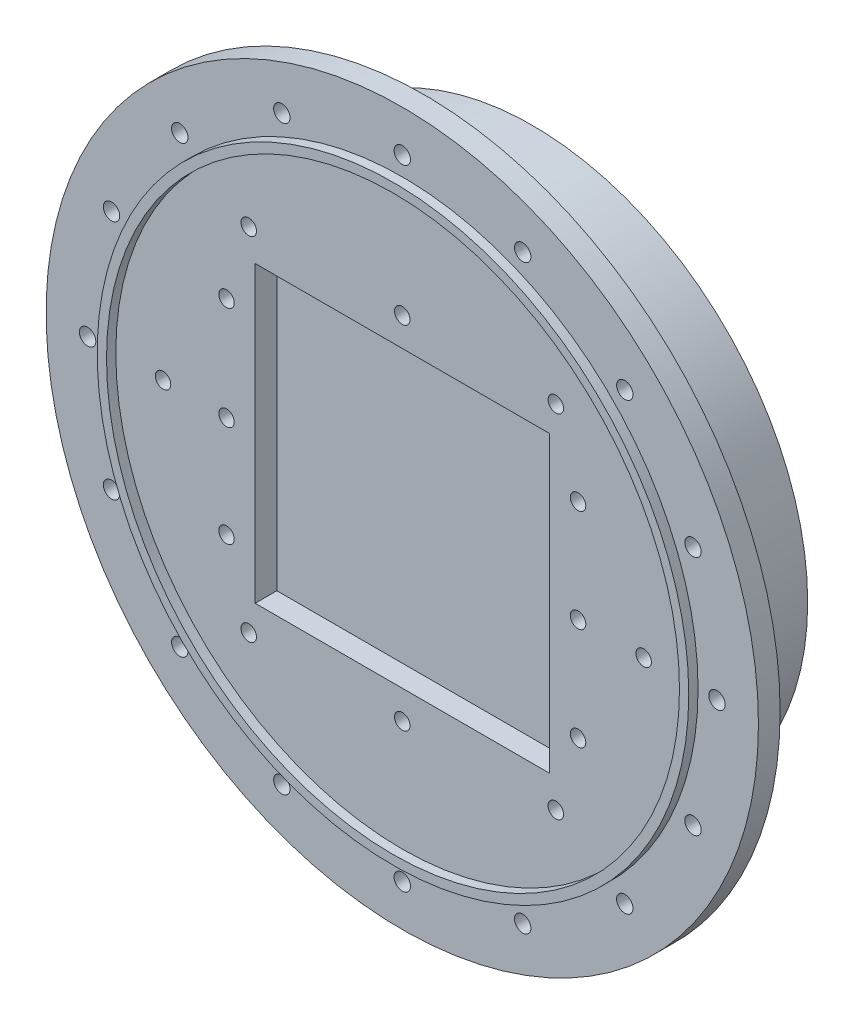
ISO-10303-21;
HEADER;
FILE_DESCRIPTION(('STEP AP214'),'2;1');
FILE_NAME('part.step','',(''),(''),'','','');
FILE_SCHEMA(('AUTOMOTIVE_DESIGN { 1 0 10303 214 1 1 1 1 }'));
ENDSEC;
DATA;
#1=APPLICATION_CONTEXT('core data for automotive mechanical design processes');
#2=APPLICATION_PROTOCOL_DEFINITION('international standard','automotive_design',2000,#1);
#3=PRODUCT_CONTEXT('',#1,'mechanical');
#4=PRODUCT('Part','Part','',(#3));
#5=PRODUCT_RELATED_PRODUCT_CATEGORY('part','',(#4));
#6=PRODUCT_DEFINITION_FORMATION('','',#4);
#7=PRODUCT_DEFINITION_CONTEXT('part definition',#1,'design');
#8=PRODUCT_DEFINITION('design','',#6,#7);
#9=PRODUCT_DEFINITION_SHAPE('','',#8);
#10=(LENGTH_UNIT() NAMED_UNIT(*) SI_UNIT(.MILLI.,.METRE.));
#11=(NAMED_UNIT(*) PLANE_ANGLE_UNIT() SI_UNIT($,.RADIAN.));
#12=(NAMED_UNIT(*) SI_UNIT($,.STERADIAN.) SOLID_ANGLE_UNIT());
#13=UNCERTAINTY_MEASURE_WITH_UNIT(LENGTH_MEASURE(1.E-05),#10,'distance_accuracy_value','');
#14=(GEOMETRIC_REPRESENTATION_CONTEXT(3) GLOBAL_UNCERTAINTY_ASSIGNED_CONTEXT((#13)) GLOBAL_UNIT_ASSIGNED_CONTEXT((#10,
#11,#12)) REPRESENTATION_CONTEXT('',''));
#15=CARTESIAN_POINT('',(0.,0.,0.));
#16=DIRECTION('',(0.,0.,1.));
#17=DIRECTION('',(1.,0.,0.));
#18=AXIS2_PLACEMENT_3D('',#15,#16,#17);
#19=CARTESIAN_POINT('',(0.,0.,0.));
#20=DIRECTION('',(0.,0.,1.));
#21=DIRECTION('',(1.,0.,0.));
#22=AXIS2_PLACEMENT_3D('',#19,#20,#21);
#23=PLANE('',#22);
#24=CARTESIAN_POINT('',(38.8806367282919,93.8661605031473,0.));
#25=DIRECTION('',(0.,0.,1.));
#26=DIRECTION('',(0.923879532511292,-0.382683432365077,0.));
#27=AXIS2_PLACEMENT_3D('',#24,#25,#26);
#28=CIRCLE('',#27,2.64999999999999);
#29=CARTESIAN_POINT('',(41.3289174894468,92.8520494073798,0.));
#30=VERTEX_POINT('',#29);
#31=EDGE_CURVE('E711',#30,#30,#28,.T.);
#32=ORIENTED_EDGE('',*,*,#31,.T.);
#33=EDGE_LOOP('',(#32));
#34=FACE_BOUND('',#33,.T.);
#35=CARTESIAN_POINT('',(71.8420489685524,71.8420489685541,0.));
#36=DIRECTION('',(0.,0.,1.));
#37=DIRECTION('',(0.707106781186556,-0.707106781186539,0.));
#38=AXIS2_PLACEMENT_3D('',#35,#36,#37);
#39=CIRCLE('',#38,2.64999999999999);
#40=CARTESIAN_POINT('',(73.7158819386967,69.9682159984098,0.));
#41=VERTEX_POINT('',#40);
#42=EDGE_CURVE('E715',#41,#41,#39,.T.);
#43=ORIENTED_EDGE('',*,*,#42,.T.);
#44=EDGE_LOOP('',(#43));
#45=FACE_BOUND('',#44,.T.);
#46=CARTESIAN_POINT('',(93.8661605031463,38.8806367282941,0.));
#47=DIRECTION('',(0.,0.,1.));
#48=DIRECTION('',(0.3826834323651,-0.923879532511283,0.));
#49=AXIS2_PLACEMENT_3D('',#46,#47,#48);
#50=CIRCLE('',#49,2.64999999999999);
#51=CARTESIAN_POINT('',(94.8802715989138,36.4323559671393,0.));
#52=VERTEX_POINT('',#51);
#53=EDGE_CURVE('E724',#52,#52,#50,.T.);
#54=ORIENTED_EDGE('',*,*,#53,.T.);
#55=EDGE_LOOP('',(#54));
#56=FACE_BOUND('',#55,.T.);
#57=CARTESIAN_POINT('',(101.6,1.06420351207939E-12,0.));
#58=DIRECTION('',(0.,0.,1.));
#59=DIRECTION('',(0.,-1.,0.));
#60=AXIS2_PLACEMENT_3D('',#57,#58,#59);
#61=CIRCLE('',#60,2.64999999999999);
#62=CARTESIAN_POINT('',(101.6,-2.64999999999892,0.));
#63=VERTEX_POINT('',#62);
#64=EDGE_CURVE('E730',#63,#63,#61,.T.);
#65=ORIENTED_EDGE('',*,*,#64,.T.);
#66=EDGE_LOOP('',(#65));
#67=FACE_BOUND('',#66,.T.);
#68=CARTESIAN_POINT('',(93.8661605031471,-38.8806367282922,0.));
#69=DIRECTION('',(0.,0.,1.));
#70=DIRECTION('',(-0.382683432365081,-0.923879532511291,0.));
#71=AXIS2_PLACEMENT_3D('',#68,#69,#70);
#72=CIRCLE('',#71,2.64999999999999);
#73=CARTESIAN_POINT('',(92.8520494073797,-41.3289174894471,0.));
#74=VERTEX_POINT('',#73);
#75=EDGE_CURVE('E736',#74,#74,#72,.T.);
#76=ORIENTED_EDGE('',*,*,#75,.T.);
#77=EDGE_LOOP('',(#76));
#78=FACE_BOUND('',#77,.T.);
#79=CARTESIAN_POINT('',(71.8420489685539,-71.8420489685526,0.));
#80=DIRECTION('',(0.,0.,1.));
#81=DIRECTION('',(-0.707106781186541,-0.707106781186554,0.));
#82=AXIS2_PLACEMENT_3D('',#79,#80,#81);
#83=CIRCLE('',#82,2.64999999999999);
#84=CARTESIAN_POINT('',(69.9682159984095,-73.715881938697,0.));
#85=VERTEX_POINT('',#84);
#86=EDGE_CURVE('E742',#85,#85,#83,.T.);
#87=ORIENTED_EDGE('',*,*,#86,.T.);
#88=EDGE_LOOP('',(#87));
#89=FACE_BOUND('',#88,.T.);
#90=CARTESIAN_POINT('',(38.8806367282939,-93.8661605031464,0.));
#91=DIRECTION('',(0.,0.,1.));
#92=DIRECTION('',(-0.923879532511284,-0.382683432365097,0.));
#93=AXIS2_PLACEMENT_3D('',#90,#91,#92);
#94=CIRCLE('',#93,2.64999999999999);
#95=CARTESIAN_POINT('',(36.432355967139,-94.8802715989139,0.));
#96=VERTEX_POINT('',#95);
#97=EDGE_CURVE('E748',#96,#96,#94,.T.);
#98=ORIENTED_EDGE('',*,*,#97,.T.);
#99=EDGE_LOOP('',(#98));
#100=FACE_BOUND('',#99,.T.);
#101=CARTESIAN_POINT('',(0.,-101.6,0.));
#102=DIRECTION('',(0.,0.,1.));
#103=DIRECTION('',(-1.,0.,0.));
#104=AXIS2_PLACEMENT_3D('',#101,#102,#103);
#105=CIRCLE('',#104,2.64999999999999);
#106=CARTESIAN_POINT('',(-2.64999999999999,-101.6,0.));
#107=VERTEX_POINT('',#106);
#108=EDGE_CURVE('E754',#107,#107,#105,.T.);
#109=ORIENTED_EDGE('',*,*,#108,.T.);
#110=EDGE_LOOP('',(#109));
#111=FACE_BOUND('',#110,.T.);
#112=CARTESIAN_POINT('',(-38.8806367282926,-93.866160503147,0.));
#113=DIRECTION('',(0.,0.,1.));
#114=DIRECTION('',(-0.923879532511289,0.382683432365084,0.));
#115=AXIS2_PLACEMENT_3D('',#112,#113,#114);
#116=CIRCLE('',#115,2.64999999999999);
#117=CARTESIAN_POINT('',(-41.3289174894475,-92.8520494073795,0.));
#118=VERTEX_POINT('',#117);
#119=EDGE_CURVE('E760',#118,#118,#116,.T.);
#120=ORIENTED_EDGE('',*,*,#119,.T.);
#121=EDGE_LOOP('',(#120));
#122=FACE_BOUND('',#121,.T.);
#123=CARTESIAN_POINT('',(-71.8420489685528,-71.8420489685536,0.));
#124=DIRECTION('',(0.,0.,1.));
#125=DIRECTION('',(-0.707106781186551,0.707106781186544,0.));
#126=AXIS2_PLACEMENT_3D('',#123,#124,#125);
#127=CIRCLE('',#126,2.64999999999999);
#128=CARTESIAN_POINT('',(-73.7158819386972,-69.9682159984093,0.));
#129=VERTEX_POINT('',#128);
#130=EDGE_CURVE('E766',#129,#129,#127,.T.);
#131=ORIENTED_EDGE('',*,*,#130,.T.);
#132=EDGE_LOOP('',(#131));
#133=FACE_BOUND('',#132,.T.);
#134=CARTESIAN_POINT('',(-93.8661605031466,-38.8806367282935,0.));
#135=DIRECTION('',(0.,0.,1.));
#136=DIRECTION('',(-0.382683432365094,0.923879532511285,0.));
#137=AXIS2_PLACEMENT_3D('',#134,#135,#136);
#138=CIRCLE('',#137,2.64999999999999);
#139=CARTESIAN_POINT('',(-94.880271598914,-36.4323559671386,0.));
#140=VERTEX_POINT('',#139);
#141=EDGE_CURVE('E772',#140,#140,#138,.T.);
#142=ORIENTED_EDGE('',*,*,#141,.T.);
#143=EDGE_LOOP('',(#142));
#144=FACE_BOUND('',#143,.T.);
#145=CARTESIAN_POINT('',(-101.6,-3.54734504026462E-13,0.));
#146=DIRECTION('',(0.,0.,1.));
#147=DIRECTION('',(0.,1.,0.));
#148=AXIS2_PLACEMENT_3D('',#145,#146,#147);
#149=CIRCLE('',#148,2.64999999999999);
#150=CARTESIAN_POINT('',(-101.6,2.64999999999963,0.));
#151=VERTEX_POINT('',#150);
#152=EDGE_CURVE('E778',#151,#151,#149,.T.);
#153=ORIENTED_EDGE('',*,*,#152,.T.);
#154=EDGE_LOOP('',(#153));
#155=FACE_BOUND('',#154,.T.);
#156=CARTESIAN_POINT('',(-93.8661605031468,38.8806367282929,0.));
#157=DIRECTION('',(0.,0.,1.));
#158=DIRECTION('',(0.382683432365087,0.923879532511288,0.));
#159=AXIS2_PLACEMENT_3D('',#156,#157,#158);
#160=CIRCLE('',#159,2.64999999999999);
#161=CARTESIAN_POINT('',(-92.8520494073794,41.3289174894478,0.));
#162=VERTEX_POINT('',#161);
#163=EDGE_CURVE('E784',#162,#162,#160,.T.);
#164=ORIENTED_EDGE('',*,*,#163,.T.);
#165=EDGE_LOOP('',(#164));
#166=FACE_BOUND('',#165,.T.);
#167=CARTESIAN_POINT('',(-71.8420489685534,71.8420489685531,0.));
#168=DIRECTION('',(0.,0.,1.));
#169=DIRECTION('',(0.707106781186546,0.707106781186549,0.));
#170=AXIS2_PLACEMENT_3D('',#167,#168,#169);
#171=CIRCLE('',#170,2.64999999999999);
#172=CARTESIAN_POINT('',(-69.968215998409,73.7158819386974,0.));
#173=VERTEX_POINT('',#172);
#174=EDGE_CURVE('E790',#173,#173,#171,.T.);
#175=ORIENTED_EDGE('',*,*,#174,.T.);
#176=EDGE_LOOP('',(#175));
#177=FACE_BOUND('',#176,.T.);
#178=CARTESIAN_POINT('',(-38.8806367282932,93.8661605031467,0.));
#179=DIRECTION('',(0.,0.,1.));
#180=DIRECTION('',(0.923879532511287,0.382683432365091,0.));
#181=AXIS2_PLACEMENT_3D('',#178,#179,#180);
#182=CIRCLE('',#181,2.64999999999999);
#183=CARTESIAN_POINT('',(-36.4323559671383,94.8802715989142,0.));
#184=VERTEX_POINT('',#183);
#185=EDGE_CURVE('E796',#184,#184,#182,.T.);
#186=ORIENTED_EDGE('',*,*,#185,.T.);
#187=EDGE_LOOP('',(#186));
#188=FACE_BOUND('',#187,.T.);
#189=CARTESIAN_POINT('',(0.,101.6,0.));
#190=DIRECTION('',(0.,0.,1.));
#191=DIRECTION('',(1.,0.,0.));
#192=AXIS2_PLACEMENT_3D('',#189,#190,#191);
#193=CIRCLE('',#192,2.64999999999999);
#194=CARTESIAN_POINT('',(2.64999999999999,101.6,0.));
#195=VERTEX_POINT('',#194);
#196=EDGE_CURVE('E40',#195,#195,#193,.T.);
#197=ORIENTED_EDGE('',*,*,#196,.T.);
#198=EDGE_LOOP('',(#197));
#199=FACE_BOUND('',#198,.T.);
#200=CARTESIAN_POINT('',(0.,0.,0.));
#201=DIRECTION('',(0.,0.,1.));
#202=DIRECTION('',(1.,0.,0.));
#203=AXIS2_PLACEMENT_3D('',#200,#201,#202);
#204=CIRCLE('',#203,115.);
#205=CARTESIAN_POINT('',(115.,0.,0.));
#206=VERTEX_POINT('',#205);
#207=EDGE_CURVE('E109',#206,#206,#204,.T.);
#208=ORIENTED_EDGE('',*,*,#207,.F.);
#209=EDGE_LOOP('',(#208));
#210=FACE_BOUND('',#209,.T.);
#211=CARTESIAN_POINT('',(0.,0.,0.));
#212=DIRECTION('',(0.,0.,1.));
#213=DIRECTION('',(1.,0.,0.));
#214=AXIS2_PLACEMENT_3D('',#211,#212,#213);
#215=CIRCLE('',#214,88.9);
#216=CARTESIAN_POINT('',(88.9,0.,0.));
#217=VERTEX_POINT('',#216);
#218=EDGE_CURVE('E11',#217,#217,#215,.F.);
#219=ORIENTED_EDGE('',*,*,#218,.F.);
#220=EDGE_LOOP('',(#219));
#221=FACE_BOUND('',#220,.T.);
#222=ADVANCED_FACE('F36',(#34,#45,#56,#67,#78,#89,#100,#111,#122,#133,#144,#155,#166,#177,#188,
#199,#210,#221),#23,.F.);
#223=CARTESIAN_POINT('',(0.,0.,7.));
#224=DIRECTION('',(0.,0.,1.));
#225=DIRECTION('',(1.,0.,0.));
#226=AXIS2_PLACEMENT_3D('',#223,#224,#225);
#227=PLANE('',#226);
#228=CARTESIAN_POINT('',(38.8806367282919,93.8661605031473,7.));
#229=DIRECTION('',(0.,0.,1.));
#230=DIRECTION('',(0.923879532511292,-0.382683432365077,0.));
#231=AXIS2_PLACEMENT_3D('',#228,#229,#230);
#232=CIRCLE('',#231,2.64999999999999);
#233=CARTESIAN_POINT('',(41.3289174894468,92.8520494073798,7.));
#234=VERTEX_POINT('',#233);
#235=EDGE_CURVE('E709',#234,#234,#232,.T.);
#236=ORIENTED_EDGE('',*,*,#235,.F.);
#237=EDGE_LOOP('',(#236));
#238=FACE_BOUND('',#237,.T.);
#239=CARTESIAN_POINT('',(71.8420489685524,71.8420489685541,7.));
#240=DIRECTION('',(0.,0.,1.));
#241=DIRECTION('',(0.707106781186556,-0.707106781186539,0.));
#242=AXIS2_PLACEMENT_3D('',#239,#240,#241);
#243=CIRCLE('',#242,2.64999999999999);
#244=CARTESIAN_POINT('',(73.7158819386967,69.9682159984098,7.));
#245=VERTEX_POINT('',#244);
#246=EDGE_CURVE('E712',#245,#245,#243,.T.);
#247=ORIENTED_EDGE('',*,*,#246,.F.);
#248=EDGE_LOOP('',(#247));
#249=FACE_BOUND('',#248,.T.);
#250=CARTESIAN_POINT('',(93.8661605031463,38.8806367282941,7.));
#251=DIRECTION('',(0.,0.,1.));
#252=DIRECTION('',(0.3826834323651,-0.923879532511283,0.));
#253=AXIS2_PLACEMENT_3D('',#250,#251,#252);
#254=CIRCLE('',#253,2.64999999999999);
#255=CARTESIAN_POINT('',(94.8802715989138,36.4323559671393,7.));
#256=VERTEX_POINT('',#255);
#257=EDGE_CURVE('E721',#256,#256,#254,.T.);
#258=ORIENTED_EDGE('',*,*,#257,.F.);
#259=EDGE_LOOP('',(#258));
#260=FACE_BOUND('',#259,.T.);
#261=CARTESIAN_POINT('',(101.6,1.06420351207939E-12,7.));
#262=DIRECTION('',(0.,0.,1.));
#263=DIRECTION('',(0.,-1.,0.));
#264=AXIS2_PLACEMENT_3D('',#261,#262,#263);
#265=CIRCLE('',#264,2.64999999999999);
#266=CARTESIAN_POINT('',(101.6,-2.64999999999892,7.));
#267=VERTEX_POINT('',#266);
#268=EDGE_CURVE('E727',#267,#267,#265,.T.);
#269=ORIENTED_EDGE('',*,*,#268,.F.);
#270=EDGE_LOOP('',(#269));
#271=FACE_BOUND('',#270,.T.);
#272=CARTESIAN_POINT('',(93.8661605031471,-38.8806367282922,7.));
#273=DIRECTION('',(0.,0.,1.));
#274=DIRECTION('',(-0.382683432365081,-0.923879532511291,0.));
#275=AXIS2_PLACEMENT_3D('',#272,#273,#274);
#276=CIRCLE('',#275,2.64999999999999);
#277=CARTESIAN_POINT('',(92.8520494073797,-41.3289174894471,7.));
#278=VERTEX_POINT('',#277);
#279=EDGE_CURVE('E733',#278,#278,#276,.T.);
#280=ORIENTED_EDGE('',*,*,#279,.F.);
#281=EDGE_LOOP('',(#280));
#282=FACE_BOUND('',#281,.T.);
#283=CARTESIAN_POINT('',(71.8420489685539,-71.8420489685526,7.));
#284=DIRECTION('',(0.,0.,1.));
#285=DIRECTION('',(-0.707106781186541,-0.707106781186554,0.));
#286=AXIS2_PLACEMENT_3D('',#283,#284,#285);
#287=CIRCLE('',#286,2.64999999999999);
#288=CARTESIAN_POINT('',(69.9682159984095,-73.715881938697,7.));
#289=VERTEX_POINT('',#288);
#290=EDGE_CURVE('E739',#289,#289,#287,.T.);
#291=ORIENTED_EDGE('',*,*,#290,.F.);
#292=EDGE_LOOP('',(#291));
#293=FACE_BOUND('',#292,.T.);
#294=CARTESIAN_POINT('',(38.8806367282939,-93.8661605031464,7.));
#295=DIRECTION('',(0.,0.,1.));
#296=DIRECTION('',(-0.923879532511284,-0.382683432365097,0.));
#297=AXIS2_PLACEMENT_3D('',#294,#295,#296);
#298=CIRCLE('',#297,2.64999999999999);
#299=CARTESIAN_POINT('',(36.432355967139,-94.8802715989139,7.));
#300=VERTEX_POINT('',#299);
#301=EDGE_CURVE('E745',#300,#300,#298,.T.);
#302=ORIENTED_EDGE('',*,*,#301,.F.);
#303=EDGE_LOOP('',(#302));
#304=FACE_BOUND('',#303,.T.);
#305=CARTESIAN_POINT('',(0.,-101.6,7.));
#306=DIRECTION('',(0.,0.,1.));
#307=DIRECTION('',(-1.,0.,0.));
#308=AXIS2_PLACEMENT_3D('',#305,#306,#307);
#309=CIRCLE('',#308,2.64999999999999);
#310=CARTESIAN_POINT('',(-2.64999999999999,-101.6,7.));
#311=VERTEX_POINT('',#310);
#312=EDGE_CURVE('E751',#311,#311,#309,.T.);
#313=ORIENTED_EDGE('',*,*,#312,.F.);
#314=EDGE_LOOP('',(#313));
#315=FACE_BOUND('',#314,.T.);
#316=CARTESIAN_POINT('',(-38.8806367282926,-93.866160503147,7.));
#317=DIRECTION('',(0.,0.,1.));
#318=DIRECTION('',(-0.923879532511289,0.382683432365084,0.));
#319=AXIS2_PLACEMENT_3D('',#316,#317,#318);
#320=CIRCLE('',#319,2.64999999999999);
#321=CARTESIAN_POINT('',(-41.3289174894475,-92.8520494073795,7.));
#322=VERTEX_POINT('',#321);
#323=EDGE_CURVE('E757',#322,#322,#320,.T.);
#324=ORIENTED_EDGE('',*,*,#323,.F.);
#325=EDGE_LOOP('',(#324));
#326=FACE_BOUND('',#325,.T.);
#327=CARTESIAN_POINT('',(-71.8420489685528,-71.8420489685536,7.));
#328=DIRECTION('',(0.,0.,1.));
#329=DIRECTION('',(-0.707106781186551,0.707106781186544,0.));
#330=AXIS2_PLACEMENT_3D('',#327,#328,#329);
#331=CIRCLE('',#330,2.64999999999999);
#332=CARTESIAN_POINT('',(-73.7158819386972,-69.9682159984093,7.));
#333=VERTEX_POINT('',#332);
#334=EDGE_CURVE('E763',#333,#333,#331,.T.);
#335=ORIENTED_EDGE('',*,*,#334,.F.);
#336=EDGE_LOOP('',(#335));
#337=FACE_BOUND('',#336,.T.);
#338=CARTESIAN_POINT('',(-93.8661605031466,-38.8806367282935,7.));
#339=DIRECTION('',(0.,0.,1.));
#340=DIRECTION('',(-0.382683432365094,0.923879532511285,0.));
#341=AXIS2_PLACEMENT_3D('',#338,#339,#340);
#342=CIRCLE('',#341,2.64999999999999);
#343=CARTESIAN_POINT('',(-94.880271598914,-36.4323559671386,7.));
#344=VERTEX_POINT('',#343);
#345=EDGE_CURVE('E769',#344,#344,#342,.T.);
#346=ORIENTED_EDGE('',*,*,#345,.F.);
#347=EDGE_LOOP('',(#346));
#348=FACE_BOUND('',#347,.T.);
#349=CARTESIAN_POINT('',(-101.6,-3.54734504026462E-13,7.));
#350=DIRECTION('',(0.,0.,1.));
#351=DIRECTION('',(0.,1.,0.));
#352=AXIS2_PLACEMENT_3D('',#349,#350,#351);
#353=CIRCLE('',#352,2.64999999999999);
#354=CARTESIAN_POINT('',(-101.6,2.64999999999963,7.));
#355=VERTEX_POINT('',#354);
#356=EDGE_CURVE('E775',#355,#355,#353,.T.);
#357=ORIENTED_EDGE('',*,*,#356,.F.);
#358=EDGE_LOOP('',(#357));
#359=FACE_BOUND('',#358,.T.);
#360=CARTESIAN_POINT('',(-93.8661605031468,38.8806367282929,7.));
#361=DIRECTION('',(0.,0.,1.));
#362=DIRECTION('',(0.382683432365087,0.923879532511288,0.));
#363=AXIS2_PLACEMENT_3D('',#360,#361,#362);
#364=CIRCLE('',#363,2.64999999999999);
#365=CARTESIAN_POINT('',(-92.8520494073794,41.3289174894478,7.));
#366=VERTEX_POINT('',#365);
#367=EDGE_CURVE('E781',#366,#366,#364,.T.);
#368=ORIENTED_EDGE('',*,*,#367,.F.);
#369=EDGE_LOOP('',(#368));
#370=FACE_BOUND('',#369,.T.);
#371=CARTESIAN_POINT('',(-71.8420489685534,71.8420489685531,7.));
#372=DIRECTION('',(0.,0.,1.));
#373=DIRECTION('',(0.707106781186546,0.707106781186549,0.));
#374=AXIS2_PLACEMENT_3D('',#371,#372,#373);
#375=CIRCLE('',#374,2.64999999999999);
#376=CARTESIAN_POINT('',(-69.968215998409,73.7158819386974,7.));
#377=VERTEX_POINT('',#376);
#378=EDGE_CURVE('E787',#377,#377,#375,.T.);
#379=ORIENTED_EDGE('',*,*,#378,.F.);
#380=EDGE_LOOP('',(#379));
#381=FACE_BOUND('',#380,.T.);
#382=CARTESIAN_POINT('',(-38.8806367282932,93.8661605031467,7.));
#383=DIRECTION('',(0.,0.,1.));
#384=DIRECTION('',(0.923879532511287,0.382683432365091,0.));
#385=AXIS2_PLACEMENT_3D('',#382,#383,#384);
#386=CIRCLE('',#385,2.64999999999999);
#387=CARTESIAN_POINT('',(-36.4323559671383,94.8802715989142,7.));
#388=VERTEX_POINT('',#387);
#389=EDGE_CURVE('E793',#388,#388,#386,.T.);
#390=ORIENTED_EDGE('',*,*,#389,.F.);
#391=EDGE_LOOP('',(#390));
#392=FACE_BOUND('',#391,.T.);
#393=CARTESIAN_POINT('',(0.,101.6,7.));
#394=DIRECTION('',(0.,0.,1.));
#395=DIRECTION('',(1.,0.,0.));
#396=AXIS2_PLACEMENT_3D('',#393,#394,#395);
#397=CIRCLE('',#396,2.64999999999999);
#398=CARTESIAN_POINT('',(2.64999999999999,101.6,7.));
#399=VERTEX_POINT('',#398);
#400=EDGE_CURVE('E798',#399,#399,#397,.T.);
#401=ORIENTED_EDGE('',*,*,#400,.F.);
#402=EDGE_LOOP('',(#401));
#403=FACE_BOUND('',#402,.T.);
#404=CARTESIAN_POINT('',(0.,0.,7.));
#405=DIRECTION('',(0.,0.,1.));
#406=DIRECTION('',(1.,0.,0.));
#407=AXIS2_PLACEMENT_3D('',#404,#405,#406);
#408=CIRCLE('',#407,115.);
#409=CARTESIAN_POINT('',(115.,0.,7.));
#410=VERTEX_POINT('',#409);
#411=EDGE_CURVE('E110',#410,#410,#408,.T.);
#412=ORIENTED_EDGE('',*,*,#411,.T.);
#413=EDGE_LOOP('',(#412));
#414=FACE_BOUND('',#413,.T.);
#415=CARTESIAN_POINT('',(0.,0.,7.));
#416=DIRECTION('',(0.,0.,1.));
#417=DIRECTION('',(1.,0.,0.));
#418=AXIS2_PLACEMENT_3D('',#415,#416,#417);
#419=CIRCLE('',#418,95.5);
#420=CARTESIAN_POINT('',(95.5,0.,7.));
#421=VERTEX_POINT('',#420);
#422=EDGE_CURVE('E212',#421,#421,#419,.T.);
#423=ORIENTED_EDGE('',*,*,#422,.F.);
#424=EDGE_LOOP('',(#423));
#425=FACE_BOUND('',#424,.T.);
#426=ADVANCED_FACE('F236',(#238,#249,#260,#271,#282,#293,#304,#315,#326,#337,#348,#359,#370,
#381,#392,#403,#414,#425),#227,.T.);
#427=CARTESIAN_POINT('',(77.9358806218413,0.,7.));
#428=DIRECTION('',(0.,0.,1.));
#429=DIRECTION('',(1.,0.,0.));
#430=AXIS2_PLACEMENT_3D('',#427,#428,#429);
#431=CIRCLE('',#430,2.49999999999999);
#432=CARTESIAN_POINT('',(80.4358806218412,0.,7.));
#433=VERTEX_POINT('',#432);
#434=EDGE_CURVE('E161',#433,#433,#431,.T.);
#435=ORIENTED_EDGE('',*,*,#434,.F.);
#436=EDGE_LOOP('',(#435));
#437=FACE_BOUND('',#436,.T.);
#438=CARTESIAN_POINT('',(-49.57572,56.74995,7.));
#439=DIRECTION('',(0.,0.,1.));
#440=DIRECTION('',(1.,0.,0.));
#441=AXIS2_PLACEMENT_3D('',#438,#439,#440);
#442=CIRCLE('',#441,2.49999999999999);
#443=CARTESIAN_POINT('',(-47.07572,56.74995,7.));
#444=VERTEX_POINT('',#443);
#445=EDGE_CURVE('E158',#444,#444,#442,.T.);
#446=ORIENTED_EDGE('',*,*,#445,.F.);
#447=EDGE_LOOP('',(#446));
#448=FACE_BOUND('',#447,.T.);
#449=CARTESIAN_POINT('',(0.,56.74995,7.));
#450=DIRECTION('',(0.,0.,1.));
#451=DIRECTION('',(1.,0.,0.));
#452=AXIS2_PLACEMENT_3D('',#449,#450,#451);
#453=CIRCLE('',#452,2.49999999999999);
#454=CARTESIAN_POINT('',(2.49999999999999,56.74995,7.));
#455=VERTEX_POINT('',#454);
#456=EDGE_CURVE('E154',#455,#455,#453,.T.);
#457=ORIENTED_EDGE('',*,*,#456,.F.);
#458=EDGE_LOOP('',(#457));
#459=FACE_BOUND('',#458,.T.);
#460=CARTESIAN_POINT('',(49.57572,56.74995,7.));
#461=DIRECTION('',(0.,0.,1.));
#462=DIRECTION('',(1.,0.,0.));
#463=AXIS2_PLACEMENT_3D('',#460,#461,#462);
#464=CIRCLE('',#463,2.49999999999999);
#465=CARTESIAN_POINT('',(52.07572,56.74995,7.));
#466=VERTEX_POINT('',#465);
#467=EDGE_CURVE('E150',#466,#466,#464,.T.);
#468=ORIENTED_EDGE('',*,*,#467,.F.);
#469=EDGE_LOOP('',(#468));
#470=FACE_BOUND('',#469,.T.);
#471=CARTESIAN_POINT('',(49.57572,-56.74995,7.));
#472=DIRECTION('',(0.,0.,1.));
#473=DIRECTION('',(1.,0.,0.));
#474=AXIS2_PLACEMENT_3D('',#471,#472,#473);
#475=CIRCLE('',#474,2.49999999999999);
#476=CARTESIAN_POINT('',(52.07572,-56.74995,7.));
#477=VERTEX_POINT('',#476);
#478=EDGE_CURVE('E146',#477,#477,#475,.T.);
#479=ORIENTED_EDGE('',*,*,#478,.F.);
#480=EDGE_LOOP('',(#479));
#481=FACE_BOUND('',#480,.T.);
#482=CARTESIAN_POINT('',(0.,-56.74995,7.));
#483=DIRECTION('',(0.,0.,1.));
#484=DIRECTION('',(1.,0.,0.));
#485=AXIS2_PLACEMENT_3D('',#482,#483,#484);
#486=CIRCLE('',#485,2.49999999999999);
#487=CARTESIAN_POINT('',(2.49999999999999,-56.74995,7.));
#488=VERTEX_POINT('',#487);
#489=EDGE_CURVE('E145',#488,#488,#486,.T.);
#490=ORIENTED_EDGE('',*,*,#489,.F.);
#491=EDGE_LOOP('',(#490));
#492=FACE_BOUND('',#491,.T.);
#493=CARTESIAN_POINT('',(-49.57572,-56.74995,7.));
#494=DIRECTION('',(0.,0.,1.));
#495=DIRECTION('',(1.,0.,0.));
#496=AXIS2_PLACEMENT_3D('',#493,#494,#495);
#497=CIRCLE('',#496,2.49999999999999);
#498=CARTESIAN_POINT('',(-47.07572,-56.74995,7.));
#499=VERTEX_POINT('',#498);
#500=EDGE_CURVE('E141',#499,#499,#497,.T.);
#501=ORIENTED_EDGE('',*,*,#500,.F.);
#502=EDGE_LOOP('',(#501));
#503=FACE_BOUND('',#502,.T.);
#504=CARTESIAN_POINT('',(-77.25029,0.,7.));
#505=DIRECTION('',(0.,0.,1.));
#506=DIRECTION('',(1.,0.,0.));
#507=AXIS2_PLACEMENT_3D('',#504,#505,#506);
#508=CIRCLE('',#507,2.49999999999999);
#509=CARTESIAN_POINT('',(-74.75029,0.,7.));
#510=VERTEX_POINT('',#509);
#511=EDGE_CURVE('E137',#510,#510,#508,.T.);
#512=ORIENTED_EDGE('',*,*,#511,.F.);
#513=EDGE_LOOP('',(#512));
#514=FACE_BOUND('',#513,.T.);
#515=CARTESIAN_POINT('',(-56.74995,-0.247808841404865,7.));
#516=DIRECTION('',(0.,0.,1.));
#517=DIRECTION('',(1.,0.,0.));
#518=AXIS2_PLACEMENT_3D('',#515,#516,#517);
#519=CIRCLE('',#518,2.49999999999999);
#520=CARTESIAN_POINT('',(-54.24995,-0.247808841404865,7.));
#521=VERTEX_POINT('',#520);
#522=EDGE_CURVE('E133',#521,#521,#519,.T.);
#523=ORIENTED_EDGE('',*,*,#522,.F.);
#524=EDGE_LOOP('',(#523));
#525=FACE_BOUND('',#524,.T.);
#526=CARTESIAN_POINT('',(-56.74995,33.05048,7.));
#527=DIRECTION('',(0.,0.,1.));
#528=DIRECTION('',(1.,0.,0.));
#529=AXIS2_PLACEMENT_3D('',#526,#527,#528);
#530=CIRCLE('',#529,2.49999999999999);
#531=CARTESIAN_POINT('',(-54.24995,33.05048,7.));
#532=VERTEX_POINT('',#531);
#533=EDGE_CURVE('E129',#532,#532,#530,.T.);
#534=ORIENTED_EDGE('',*,*,#533,.F.);
#535=EDGE_LOOP('',(#534));
#536=FACE_BOUND('',#535,.T.);
#537=CARTESIAN_POINT('',(-56.74995,-32.9585759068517,7.));
#538=DIRECTION('',(0.,0.,1.));
#539=DIRECTION('',(1.,0.,0.));
#540=AXIS2_PLACEMENT_3D('',#537,#538,#539);
#541=CIRCLE('',#540,2.49999999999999);
#542=CARTESIAN_POINT('',(-54.24995,-32.9585759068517,7.));
#543=VERTEX_POINT('',#542);
#544=EDGE_CURVE('E125',#543,#543,#541,.T.);
#545=ORIENTED_EDGE('',*,*,#544,.F.);
#546=EDGE_LOOP('',(#545));
#547=FACE_BOUND('',#546,.T.);
#548=CARTESIAN_POINT('',(56.74995,33.05048,7.));
#549=DIRECTION('',(0.,0.,1.));
#550=DIRECTION('',(1.,0.,0.));
#551=AXIS2_PLACEMENT_3D('',#548,#549,#550);
#552=CIRCLE('',#551,2.49999999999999);
#553=CARTESIAN_POINT('',(59.24995,33.05048,7.));
#554=VERTEX_POINT('',#553);
#555=EDGE_CURVE('E121',#554,#554,#552,.T.);
#556=ORIENTED_EDGE('',*,*,#555,.F.);
#557=EDGE_LOOP('',(#556));
#558=FACE_BOUND('',#557,.T.);
#559=CARTESIAN_POINT('',(56.74995,0.,7.));
#560=DIRECTION('',(0.,0.,1.));
#561=DIRECTION('',(1.,0.,0.));
#562=AXIS2_PLACEMENT_3D('',#559,#560,#561);
#563=CIRCLE('',#562,2.49999999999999);
#564=CARTESIAN_POINT('',(59.24995,0.,7.));
#565=VERTEX_POINT('',#564);
#566=EDGE_CURVE('E120',#565,#565,#563,.T.);
#567=ORIENTED_EDGE('',*,*,#566,.F.);
#568=EDGE_LOOP('',(#567));
#569=FACE_BOUND('',#568,.T.);
#570=CARTESIAN_POINT('',(56.74995,-33.05048,7.));
#571=DIRECTION('',(0.,0.,1.));
#572=DIRECTION('',(1.,0.,0.));
#573=AXIS2_PLACEMENT_3D('',#570,#571,#572);
#574=CIRCLE('',#573,2.49999999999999);
#575=CARTESIAN_POINT('',(59.24995,-33.05048,7.));
#576=VERTEX_POINT('',#575);
#577=EDGE_CURVE('E203',#576,#576,#574,.T.);
#578=ORIENTED_EDGE('',*,*,#577,.F.);
#579=EDGE_LOOP('',(#578));
#580=FACE_BOUND('',#579,.T.);
#581=CARTESIAN_POINT('',(0.,0.,7.));
#582=DIRECTION('',(0.,0.,1.));
#583=DIRECTION('',(1.,0.,0.));
#584=AXIS2_PLACEMENT_3D('',#581,#582,#583);
#585=CIRCLE('',#584,92.5);
#586=CARTESIAN_POINT('',(92.5,0.,7.));
#587=VERTEX_POINT('',#586);
#588=EDGE_CURVE('E45',#587,#587,#585,.F.);
#589=ORIENTED_EDGE('',*,*,#588,.F.);
#590=EDGE_LOOP('',(#589));
#591=FACE_BOUND('',#590,.T.);
#592=DIRECTION('',(1.,0.,0.));
#593=VECTOR('',#592,1.);
#594=CARTESIAN_POINT('',(-47.5,-47.5,7.));
#595=LINE('',#594,#593);
#596=CARTESIAN_POINT('',(-47.5,-47.5,7.));
#597=VERTEX_POINT('',#596);
#598=CARTESIAN_POINT('',(47.5,-47.5,7.));
#599=VERTEX_POINT('',#598);
#600=EDGE_CURVE('E100',#597,#599,#595,.T.);
#601=ORIENTED_EDGE('',*,*,#600,.F.);
#602=DIRECTION('',(0.,-1.,0.));
#603=VECTOR('',#602,1.);
#604=CARTESIAN_POINT('',(-47.5,47.5,7.));
#605=LINE('',#604,#603);
#606=CARTESIAN_POINT('',(-47.5,47.5,7.));
#607=VERTEX_POINT('',#606);
#608=EDGE_CURVE('E78',#607,#597,#605,.T.);
#609=ORIENTED_EDGE('',*,*,#608,.F.);
#610=DIRECTION('',(-1.,0.,0.));
#611=VECTOR('',#610,1.);
#612=CARTESIAN_POINT('',(-47.5,47.5,7.));
#613=LINE('',#612,#611);
#614=CARTESIAN_POINT('',(47.5,47.5,7.));
#615=VERTEX_POINT('',#614);
#616=EDGE_CURVE('E58',#615,#607,#613,.T.);
#617=ORIENTED_EDGE('',*,*,#616,.F.);
#618=DIRECTION('',(0.,1.,0.));
#619=VECTOR('',#618,1.);
#620=CARTESIAN_POINT('',(47.5,47.5,7.));
#621=LINE('',#620,#619);
#622=EDGE_CURVE('E218',#599,#615,#621,.T.);
#623=ORIENTED_EDGE('',*,*,#622,.F.);
#624=EDGE_LOOP('',(#601,#609,#617,#623));
#625=FACE_BOUND('',#624,.T.);
#626=ADVANCED_FACE('F241',(#437,#448,#459,#470,#481,#492,#503,#514,#525,#536,#547,#558,#569,
#580,#591,#625),#227,.T.);
#627=CARTESIAN_POINT('',(0.,0.,7.));
#628=DIRECTION('',(0.,0.,-1.));
#629=DIRECTION('',(-1.,0.,0.));
#630=AXIS2_PLACEMENT_3D('',#627,#628,#629);
#631=CYLINDRICAL_SURFACE('',#630,115.);
#632=ORIENTED_EDGE('',*,*,#411,.F.);
#633=EDGE_LOOP('',(#632));
#634=FACE_BOUND('',#633,.T.);
#635=ORIENTED_EDGE('',*,*,#207,.T.);
#636=EDGE_LOOP('',(#635));
#637=FACE_BOUND('',#636,.T.);
#638=ADVANCED_FACE('F38',(#634,#637),#631,.T.);
#639=CARTESIAN_POINT('',(-47.5,47.5,7.));
#640=DIRECTION('',(1.,0.,0.));
#641=DIRECTION('',(0.,1.,0.));
#642=AXIS2_PLACEMENT_3D('',#639,#640,#641);
#643=PLANE('',#642);
#644=DIRECTION('',(0.,-1.,0.));
#645=VECTOR('',#644,1.);
#646=CARTESIAN_POINT('',(-47.5,47.5,0.));
#647=LINE('',#646,#645);
#648=CARTESIAN_POINT('',(-47.5,47.5,0.));
#649=VERTEX_POINT('',#648);
#650=CARTESIAN_POINT('',(-47.5,-47.5,0.));
#651=VERTEX_POINT('',#650);
#652=EDGE_CURVE('E89',#649,#651,#647,.T.);
#653=ORIENTED_EDGE('',*,*,#652,.F.);
#654=DIRECTION('',(0.,0.,-1.));
#655=VECTOR('',#654,1.);
#656=CARTESIAN_POINT('',(-47.5,47.5,7.));
#657=LINE('',#656,#655);
#658=EDGE_CURVE('E81',#607,#649,#657,.T.);
#659=ORIENTED_EDGE('',*,*,#658,.F.);
#660=ORIENTED_EDGE('',*,*,#608,.T.);
#661=DIRECTION('',(0.,0.,-1.));
#662=VECTOR('',#661,1.);
#663=CARTESIAN_POINT('',(-47.5,-47.5,7.));
#664=LINE('',#663,#662);
#665=EDGE_CURVE('E91',#597,#651,#664,.T.);
#666=ORIENTED_EDGE('',*,*,#665,.T.);
#667=EDGE_LOOP('',(#653,#659,#660,#666));
#668=FACE_BOUND('',#667,.T.);
#669=ADVANCED_FACE('F90',(#668),#643,.T.);
#670=CARTESIAN_POINT('',(-47.5,-47.5,7.));
#671=DIRECTION('',(0.,1.,0.));
#672=DIRECTION('',(-1.,0.,0.));
#673=AXIS2_PLACEMENT_3D('',#670,#671,#672);
#674=PLANE('',#673);
#675=DIRECTION('',(1.,0.,0.));
#676=VECTOR('',#675,1.);
#677=CARTESIAN_POINT('',(-47.5,-47.5,0.));
#678=LINE('',#677,#676);
#679=CARTESIAN_POINT('',(47.5,-47.5,0.));
#680=VERTEX_POINT('',#679);
#681=EDGE_CURVE('E94',#651,#680,#678,.T.);
#682=ORIENTED_EDGE('',*,*,#681,.F.);
#683=ORIENTED_EDGE('',*,*,#665,.F.);
#684=ORIENTED_EDGE('',*,*,#600,.T.);
#685=DIRECTION('',(0.,0.,-1.));
#686=VECTOR('',#685,1.);
#687=CARTESIAN_POINT('',(47.5,-47.5,7.));
#688=LINE('',#687,#686);
#689=EDGE_CURVE('E106',#599,#680,#688,.T.);
#690=ORIENTED_EDGE('',*,*,#689,.T.);
#691=EDGE_LOOP('',(#682,#683,#684,#690));
#692=FACE_BOUND('',#691,.T.);
#693=ADVANCED_FACE('F221',(#692),#674,.T.);
#694=CARTESIAN_POINT('',(47.5,47.5,7.));
#695=DIRECTION('',(-1.,0.,0.));
#696=DIRECTION('',(0.,-1.,0.));
#697=AXIS2_PLACEMENT_3D('',#694,#695,#696);
#698=PLANE('',#697);
#699=DIRECTION('',(0.,1.,0.));
#700=VECTOR('',#699,1.);
#701=CARTESIAN_POINT('',(47.5,47.5,0.));
#702=LINE('',#701,#700);
#703=CARTESIAN_POINT('',(47.5,47.5,0.));
#704=VERTEX_POINT('',#703);
#705=EDGE_CURVE('E98',#680,#704,#702,.T.);
#706=ORIENTED_EDGE('',*,*,#705,.F.);
#707=ORIENTED_EDGE('',*,*,#689,.F.);
#708=ORIENTED_EDGE('',*,*,#622,.T.);
#709=DIRECTION('',(0.,0.,-1.));
#710=VECTOR('',#709,1.);
#711=CARTESIAN_POINT('',(47.5,47.5,7.));
#712=LINE('',#711,#710);
#713=EDGE_CURVE('E52',#615,#704,#712,.T.);
#714=ORIENTED_EDGE('',*,*,#713,.T.);
#715=EDGE_LOOP('',(#706,#707,#708,#714));
#716=FACE_BOUND('',#715,.T.);
#717=ADVANCED_FACE('F225',(#716),#698,.T.);
#718=CARTESIAN_POINT('',(-47.5,47.5,7.));
#719=DIRECTION('',(0.,-1.,0.));
#720=DIRECTION('',(1.,0.,0.));
#721=AXIS2_PLACEMENT_3D('',#718,#719,#720);
#722=PLANE('',#721);
#723=DIRECTION('',(-1.,0.,0.));
#724=VECTOR('',#723,1.);
#725=CARTESIAN_POINT('',(-47.5,47.5,0.));
#726=LINE('',#725,#724);
#727=EDGE_CURVE('E85',#704,#649,#726,.T.);
#728=ORIENTED_EDGE('',*,*,#727,.F.);
#729=ORIENTED_EDGE('',*,*,#713,.F.);
#730=ORIENTED_EDGE('',*,*,#616,.T.);
#731=ORIENTED_EDGE('',*,*,#658,.T.);
#732=EDGE_LOOP('',(#728,#729,#730,#731));
#733=FACE_BOUND('',#732,.T.);
#734=ADVANCED_FACE('F83',(#733),#722,.T.);
#735=CARTESIAN_POINT('',(0.,0.,10.));
#736=DIRECTION('',(0.,0.,1.));
#737=DIRECTION('',(1.,0.,0.));
#738=AXIS2_PLACEMENT_3D('',#735,#736,#737);
#739=PLANE('',#738);
#740=CARTESIAN_POINT('',(0.,0.,10.));
#741=DIRECTION('',(0.,0.,1.));
#742=DIRECTION('',(1.,0.,0.));
#743=AXIS2_PLACEMENT_3D('',#740,#741,#742);
#744=CIRCLE('',#743,95.5);
#745=CARTESIAN_POINT('',(95.5,0.,10.));
#746=VERTEX_POINT('',#745);
#747=EDGE_CURVE('E95',#746,#746,#744,.T.);
#748=ORIENTED_EDGE('',*,*,#747,.T.);
#749=EDGE_LOOP('',(#748));
#750=FACE_BOUND('',#749,.T.);
#751=CARTESIAN_POINT('',(0.,0.,10.));
#752=DIRECTION('',(0.,0.,1.));
#753=DIRECTION('',(1.,0.,0.));
#754=AXIS2_PLACEMENT_3D('',#751,#752,#753);
#755=CIRCLE('',#754,92.5);
#756=CARTESIAN_POINT('',(92.5,0.,10.));
#757=VERTEX_POINT('',#756);
#758=EDGE_CURVE('E209',#757,#757,#755,.T.);
#759=ORIENTED_EDGE('',*,*,#758,.F.);
#760=EDGE_LOOP('',(#759));
#761=FACE_BOUND('',#760,.T.);
#762=ADVANCED_FACE('F232',(#750,#761),#739,.T.);
#763=CARTESIAN_POINT('',(0.,0.,10.));
#764=DIRECTION('',(0.,0.,-1.));
#765=DIRECTION('',(-1.,0.,0.));
#766=AXIS2_PLACEMENT_3D('',#763,#764,#765);
#767=CYLINDRICAL_SURFACE('',#766,95.5);
#768=ORIENTED_EDGE('',*,*,#747,.F.);
#769=EDGE_LOOP('',(#768));
#770=FACE_BOUND('',#769,.T.);
#771=ORIENTED_EDGE('',*,*,#422,.T.);
#772=EDGE_LOOP('',(#771));
#773=FACE_BOUND('',#772,.T.);
#774=ADVANCED_FACE('F338',(#770,#773),#767,.T.);
#775=CARTESIAN_POINT('',(0.,0.,10.));
#776=DIRECTION('',(0.,0.,-1.));
#777=DIRECTION('',(-1.,0.,0.));
#778=AXIS2_PLACEMENT_3D('',#775,#776,#777);
#779=CYLINDRICAL_SURFACE('',#778,92.5);
#780=ORIENTED_EDGE('',*,*,#758,.T.);
#781=EDGE_LOOP('',(#780));
#782=FACE_BOUND('',#781,.T.);
#783=ORIENTED_EDGE('',*,*,#588,.T.);
#784=EDGE_LOOP('',(#783));
#785=FACE_BOUND('',#784,.T.);
#786=ADVANCED_FACE('F334',(#782,#785),#779,.F.);
#787=CARTESIAN_POINT('',(56.74995,-33.05048,7.));
#788=DIRECTION('',(0.,0.,1.));
#789=DIRECTION('',(1.,0.,0.));
#790=AXIS2_PLACEMENT_3D('',#787,#788,#789);
#791=CYLINDRICAL_SURFACE('',#790,2.49999999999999);
#792=ORIENTED_EDGE('',*,*,#577,.T.);
#793=EDGE_LOOP('',(#792));
#794=FACE_BOUND('',#793,.T.);
#795=CARTESIAN_POINT('',(56.74995,-33.05048,0.));
#796=DIRECTION('',(0.,0.,1.));
#797=DIRECTION('',(1.,0.,0.));
#798=AXIS2_PLACEMENT_3D('',#795,#796,#797);
#799=CIRCLE('',#798,2.49999999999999);
#800=CARTESIAN_POINT('',(59.24995,-33.05048,0.));
#801=VERTEX_POINT('',#800);
#802=EDGE_CURVE('E206',#801,#801,#799,.T.);
#803=ORIENTED_EDGE('',*,*,#802,.F.);
#804=EDGE_LOOP('',(#803));
#805=FACE_BOUND('',#804,.T.);
#806=ADVANCED_FACE('F330',(#794,#805),#791,.F.);
#807=CARTESIAN_POINT('',(56.74995,0.,7.));
#808=DIRECTION('',(0.,0.,1.));
#809=DIRECTION('',(1.,0.,0.));
#810=AXIS2_PLACEMENT_3D('',#807,#808,#809);
#811=CYLINDRICAL_SURFACE('',#810,2.49999999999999);
#812=ORIENTED_EDGE('',*,*,#566,.T.);
#813=EDGE_LOOP('',(#812));
#814=FACE_BOUND('',#813,.T.);
#815=CARTESIAN_POINT('',(56.74995,0.,0.));
#816=DIRECTION('',(0.,0.,1.));
#817=DIRECTION('',(1.,0.,0.));
#818=AXIS2_PLACEMENT_3D('',#815,#816,#817);
#819=CIRCLE('',#818,2.49999999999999);
#820=CARTESIAN_POINT('',(59.24995,0.,0.));
#821=VERTEX_POINT('',#820);
#822=EDGE_CURVE('E200',#821,#821,#819,.T.);
#823=ORIENTED_EDGE('',*,*,#822,.F.);
#824=EDGE_LOOP('',(#823));
#825=FACE_BOUND('',#824,.T.);
#826=ADVANCED_FACE('F326',(#814,#825),#811,.F.);
#827=CARTESIAN_POINT('',(56.74995,33.05048,7.));
#828=DIRECTION('',(0.,0.,1.));
#829=DIRECTION('',(1.,0.,0.));
#830=AXIS2_PLACEMENT_3D('',#827,#828,#829);
#831=CYLINDRICAL_SURFACE('',#830,2.49999999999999);
#832=ORIENTED_EDGE('',*,*,#555,.T.);
#833=EDGE_LOOP('',(#832));
#834=FACE_BOUND('',#833,.T.);
#835=CARTESIAN_POINT('',(56.74995,33.05048,0.));
#836=DIRECTION('',(0.,0.,1.));
#837=DIRECTION('',(1.,0.,0.));
#838=AXIS2_PLACEMENT_3D('',#835,#836,#837);
#839=CIRCLE('',#838,2.49999999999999);
#840=CARTESIAN_POINT('',(59.24995,33.05048,0.));
#841=VERTEX_POINT('',#840);
#842=EDGE_CURVE('E117',#841,#841,#839,.T.);
#843=ORIENTED_EDGE('',*,*,#842,.F.);
#844=EDGE_LOOP('',(#843));
#845=FACE_BOUND('',#844,.T.);
#846=ADVANCED_FACE('F322',(#834,#845),#831,.F.);
#847=CARTESIAN_POINT('',(-56.74995,-32.9585759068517,7.));
#848=DIRECTION('',(0.,0.,1.));
#849=DIRECTION('',(1.,0.,0.));
#850=AXIS2_PLACEMENT_3D('',#847,#848,#849);
#851=CYLINDRICAL_SURFACE('',#850,2.49999999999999);
#852=ORIENTED_EDGE('',*,*,#544,.T.);
#853=EDGE_LOOP('',(#852));
#854=FACE_BOUND('',#853,.T.);
#855=CARTESIAN_POINT('',(-56.74995,-32.9585759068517,0.));
#856=DIRECTION('',(0.,0.,1.));
#857=DIRECTION('',(1.,0.,0.));
#858=AXIS2_PLACEMENT_3D('',#855,#856,#857);
#859=CIRCLE('',#858,2.49999999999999);
#860=CARTESIAN_POINT('',(-54.24995,-32.9585759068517,0.));
#861=VERTEX_POINT('',#860);
#862=EDGE_CURVE('E122',#861,#861,#859,.T.);
#863=ORIENTED_EDGE('',*,*,#862,.F.);
#864=EDGE_LOOP('',(#863));
#865=FACE_BOUND('',#864,.T.);
#866=ADVANCED_FACE('F318',(#854,#865),#851,.F.);
#867=CARTESIAN_POINT('',(-56.74995,33.05048,7.));
#868=DIRECTION('',(0.,0.,1.));
#869=DIRECTION('',(1.,0.,0.));
#870=AXIS2_PLACEMENT_3D('',#867,#868,#869);
#871=CYLINDRICAL_SURFACE('',#870,2.49999999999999);
#872=ORIENTED_EDGE('',*,*,#533,.T.);
#873=EDGE_LOOP('',(#872));
#874=FACE_BOUND('',#873,.T.);
#875=CARTESIAN_POINT('',(-56.74995,33.05048,0.));
#876=DIRECTION('',(0.,0.,1.));
#877=DIRECTION('',(1.,0.,0.));
#878=AXIS2_PLACEMENT_3D('',#875,#876,#877);
#879=CIRCLE('',#878,2.49999999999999);
#880=CARTESIAN_POINT('',(-54.24995,33.05048,0.));
#881=VERTEX_POINT('',#880);
#882=EDGE_CURVE('E126',#881,#881,#879,.T.);
#883=ORIENTED_EDGE('',*,*,#882,.F.);
#884=EDGE_LOOP('',(#883));
#885=FACE_BOUND('',#884,.T.);
#886=ADVANCED_FACE('F314',(#874,#885),#871,.F.);
#887=CARTESIAN_POINT('',(-56.74995,-0.247808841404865,7.));
#888=DIRECTION('',(0.,0.,1.));
#889=DIRECTION('',(1.,0.,0.));
#890=AXIS2_PLACEMENT_3D('',#887,#888,#889);
#891=CYLINDRICAL_SURFACE('',#890,2.49999999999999);
#892=ORIENTED_EDGE('',*,*,#522,.T.);
#893=EDGE_LOOP('',(#892));
#894=FACE_BOUND('',#893,.T.);
#895=CARTESIAN_POINT('',(-56.74995,-0.247808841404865,0.));
#896=DIRECTION('',(0.,0.,1.));
#897=DIRECTION('',(1.,0.,0.));
#898=AXIS2_PLACEMENT_3D('',#895,#896,#897);
#899=CIRCLE('',#898,2.49999999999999);
#900=CARTESIAN_POINT('',(-54.24995,-0.247808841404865,0.));
#901=VERTEX_POINT('',#900);
#902=EDGE_CURVE('E130',#901,#901,#899,.T.);
#903=ORIENTED_EDGE('',*,*,#902,.F.);
#904=EDGE_LOOP('',(#903));
#905=FACE_BOUND('',#904,.T.);
#906=ADVANCED_FACE('F310',(#894,#905),#891,.F.);
#907=CARTESIAN_POINT('',(-77.25029,0.,7.));
#908=DIRECTION('',(0.,0.,1.));
#909=DIRECTION('',(1.,0.,0.));
#910=AXIS2_PLACEMENT_3D('',#907,#908,#909);
#911=CYLINDRICAL_SURFACE('',#910,2.49999999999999);
#912=ORIENTED_EDGE('',*,*,#511,.T.);
#913=EDGE_LOOP('',(#912));
#914=FACE_BOUND('',#913,.T.);
#915=CARTESIAN_POINT('',(-77.25029,0.,0.));
#916=DIRECTION('',(0.,0.,1.));
#917=DIRECTION('',(1.,0.,0.));
#918=AXIS2_PLACEMENT_3D('',#915,#916,#917);
#919=CIRCLE('',#918,2.49999999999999);
#920=CARTESIAN_POINT('',(-74.75029,0.,0.));
#921=VERTEX_POINT('',#920);
#922=EDGE_CURVE('E134',#921,#921,#919,.T.);
#923=ORIENTED_EDGE('',*,*,#922,.F.);
#924=EDGE_LOOP('',(#923));
#925=FACE_BOUND('',#924,.T.);
#926=ADVANCED_FACE('F306',(#914,#925),#911,.F.);
#927=CARTESIAN_POINT('',(-49.57572,-56.74995,7.));
#928=DIRECTION('',(0.,0.,1.));
#929=DIRECTION('',(1.,0.,0.));
#930=AXIS2_PLACEMENT_3D('',#927,#928,#929);
#931=CYLINDRICAL_SURFACE('',#930,2.49999999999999);
#932=ORIENTED_EDGE('',*,*,#500,.T.);
#933=EDGE_LOOP('',(#932));
#934=FACE_BOUND('',#933,.T.);
#935=CARTESIAN_POINT('',(-49.57572,-56.74995,0.));
#936=DIRECTION('',(0.,0.,1.));
#937=DIRECTION('',(1.,0.,0.));
#938=AXIS2_PLACEMENT_3D('',#935,#936,#937);
#939=CIRCLE('',#938,2.49999999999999);
#940=CARTESIAN_POINT('',(-47.07572,-56.74995,0.));
#941=VERTEX_POINT('',#940);
#942=EDGE_CURVE('E138',#941,#941,#939,.T.);
#943=ORIENTED_EDGE('',*,*,#942,.F.);
#944=EDGE_LOOP('',(#943));
#945=FACE_BOUND('',#944,.T.);
#946=ADVANCED_FACE('F302',(#934,#945),#931,.F.);
#947=CARTESIAN_POINT('',(0.,-56.74995,7.));
#948=DIRECTION('',(0.,0.,1.));
#949=DIRECTION('',(1.,0.,0.));
#950=AXIS2_PLACEMENT_3D('',#947,#948,#949);
#951=CYLINDRICAL_SURFACE('',#950,2.49999999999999);
#952=ORIENTED_EDGE('',*,*,#489,.T.);
#953=EDGE_LOOP('',(#952));
#954=FACE_BOUND('',#953,.T.);
#955=CARTESIAN_POINT('',(0.,-56.74995,0.));
#956=DIRECTION('',(0.,0.,1.));
#957=DIRECTION('',(1.,0.,0.));
#958=AXIS2_PLACEMENT_3D('',#955,#956,#957);
#959=CIRCLE('',#958,2.49999999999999);
#960=CARTESIAN_POINT('',(2.49999999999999,-56.74995,0.));
#961=VERTEX_POINT('',#960);
#962=EDGE_CURVE('E183',#961,#961,#959,.T.);
#963=ORIENTED_EDGE('',*,*,#962,.F.);
#964=EDGE_LOOP('',(#963));
#965=FACE_BOUND('',#964,.T.);
#966=ADVANCED_FACE('F298',(#954,#965),#951,.F.);
#967=CARTESIAN_POINT('',(49.57572,-56.74995,7.));
#968=DIRECTION('',(0.,0.,1.));
#969=DIRECTION('',(1.,0.,0.));
#970=AXIS2_PLACEMENT_3D('',#967,#968,#969);
#971=CYLINDRICAL_SURFACE('',#970,2.49999999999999);
#972=ORIENTED_EDGE('',*,*,#478,.T.);
#973=EDGE_LOOP('',(#972));
#974=FACE_BOUND('',#973,.T.);
#975=CARTESIAN_POINT('',(49.57572,-56.74995,0.));
#976=DIRECTION('',(0.,0.,1.));
#977=DIRECTION('',(1.,0.,0.));
#978=AXIS2_PLACEMENT_3D('',#975,#976,#977);
#979=CIRCLE('',#978,2.49999999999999);
#980=CARTESIAN_POINT('',(52.07572,-56.74995,0.));
#981=VERTEX_POINT('',#980);
#982=EDGE_CURVE('E142',#981,#981,#979,.T.);
#983=ORIENTED_EDGE('',*,*,#982,.F.);
#984=EDGE_LOOP('',(#983));
#985=FACE_BOUND('',#984,.T.);
#986=ADVANCED_FACE('F294',(#974,#985),#971,.F.);
#987=CARTESIAN_POINT('',(49.57572,56.74995,7.));
#988=DIRECTION('',(0.,0.,1.));
#989=DIRECTION('',(1.,0.,0.));
#990=AXIS2_PLACEMENT_3D('',#987,#988,#989);
#991=CYLINDRICAL_SURFACE('',#990,2.49999999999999);
#992=ORIENTED_EDGE('',*,*,#467,.T.);
#993=EDGE_LOOP('',(#992));
#994=FACE_BOUND('',#993,.T.);
#995=CARTESIAN_POINT('',(49.57572,56.74995,0.));
#996=DIRECTION('',(0.,0.,1.));
#997=DIRECTION('',(1.,0.,0.));
#998=AXIS2_PLACEMENT_3D('',#995,#996,#997);
#999=CIRCLE('',#998,2.49999999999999);
#1000=CARTESIAN_POINT('',(52.07572,56.74995,0.));
#1001=VERTEX_POINT('',#1000);
#1002=EDGE_CURVE('E147',#1001,#1001,#999,.T.);
#1003=ORIENTED_EDGE('',*,*,#1002,.F.);
#1004=EDGE_LOOP('',(#1003));
#1005=FACE_BOUND('',#1004,.T.);
#1006=ADVANCED_FACE('F290',(#994,#1005),#991,.F.);
#1007=CARTESIAN_POINT('',(0.,56.74995,7.));
#1008=DIRECTION('',(0.,0.,1.));
#1009=DIRECTION('',(1.,0.,0.));
#1010=AXIS2_PLACEMENT_3D('',#1007,#1008,#1009);
#1011=CYLINDRICAL_SURFACE('',#1010,2.49999999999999);
#1012=ORIENTED_EDGE('',*,*,#456,.T.);
#1013=EDGE_LOOP('',(#1012));
#1014=FACE_BOUND('',#1013,.T.);
#1015=CARTESIAN_POINT('',(0.,56.74995,0.));
#1016=DIRECTION('',(0.,0.,1.));
#1017=DIRECTION('',(1.,0.,0.));
#1018=AXIS2_PLACEMENT_3D('',#1015,#1016,#1017);
#1019=CIRCLE('',#1018,2.49999999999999);
#1020=CARTESIAN_POINT('',(2.49999999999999,56.74995,0.));
#1021=VERTEX_POINT('',#1020);
#1022=EDGE_CURVE('E151',#1021,#1021,#1019,.T.);
#1023=ORIENTED_EDGE('',*,*,#1022,.F.);
#1024=EDGE_LOOP('',(#1023));
#1025=FACE_BOUND('',#1024,.T.);
#1026=ADVANCED_FACE('F286',(#1014,#1025),#1011,.F.);
#1027=CARTESIAN_POINT('',(-49.57572,56.74995,7.));
#1028=DIRECTION('',(0.,0.,1.));
#1029=DIRECTION('',(1.,0.,0.));
#1030=AXIS2_PLACEMENT_3D('',#1027,#1028,#1029);
#1031=CYLINDRICAL_SURFACE('',#1030,2.49999999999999);
#1032=ORIENTED_EDGE('',*,*,#445,.T.);
#1033=EDGE_LOOP('',(#1032));
#1034=FACE_BOUND('',#1033,.T.);
#1035=CARTESIAN_POINT('',(-49.57572,56.74995,0.));
#1036=DIRECTION('',(0.,0.,1.));
#1037=DIRECTION('',(1.,0.,0.));
#1038=AXIS2_PLACEMENT_3D('',#1035,#1036,#1037);
#1039=CIRCLE('',#1038,2.49999999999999);
#1040=CARTESIAN_POINT('',(-47.07572,56.74995,0.));
#1041=VERTEX_POINT('',#1040);
#1042=EDGE_CURVE('E155',#1041,#1041,#1039,.T.);
#1043=ORIENTED_EDGE('',*,*,#1042,.F.);
#1044=EDGE_LOOP('',(#1043));
#1045=FACE_BOUND('',#1044,.T.);
#1046=ADVANCED_FACE('F283',(#1034,#1045),#1031,.F.);
#1047=CARTESIAN_POINT('',(77.9358806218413,0.,7.));
#1048=DIRECTION('',(0.,0.,1.));
#1049=DIRECTION('',(1.,0.,0.));
#1050=AXIS2_PLACEMENT_3D('',#1047,#1048,#1049);
#1051=CYLINDRICAL_SURFACE('',#1050,2.49999999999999);
#1052=ORIENTED_EDGE('',*,*,#434,.T.);
#1053=EDGE_LOOP('',(#1052));
#1054=FACE_BOUND('',#1053,.T.);
#1055=CARTESIAN_POINT('',(77.9358806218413,0.,0.));
#1056=DIRECTION('',(0.,0.,1.));
#1057=DIRECTION('',(1.,0.,0.));
#1058=AXIS2_PLACEMENT_3D('',#1055,#1056,#1057);
#1059=CIRCLE('',#1058,2.49999999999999);
#1060=CARTESIAN_POINT('',(80.4358806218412,0.,0.));
#1061=VERTEX_POINT('',#1060);
#1062=EDGE_CURVE('E159',#1061,#1061,#1059,.T.);
#1063=ORIENTED_EDGE('',*,*,#1062,.F.);
#1064=EDGE_LOOP('',(#1063));
#1065=FACE_BOUND('',#1064,.T.);
#1066=ADVANCED_FACE('F280',(#1054,#1065),#1051,.F.);
#1067=CARTESIAN_POINT('',(0.,0.,0.));
#1068=DIRECTION('',(0.,0.,-1.));
#1069=DIRECTION('',(-1.,0.,0.));
#1070=AXIS2_PLACEMENT_3D('',#1067,#1068,#1069);
#1071=PLANE('',#1070);
#1072=ORIENTED_EDGE('',*,*,#1062,.T.);
#1073=EDGE_LOOP('',(#1072));
#1074=FACE_BOUND('',#1073,.T.);
#1075=ADVANCED_FACE('F277',(#1074),#1071,.F.);
#1076=ORIENTED_EDGE('',*,*,#1042,.T.);
#1077=EDGE_LOOP('',(#1076));
#1078=FACE_BOUND('',#1077,.T.);
#1079=ADVANCED_FACE('F426',(#1078),#1071,.F.);
#1080=ORIENTED_EDGE('',*,*,#1022,.T.);
#1081=EDGE_LOOP('',(#1080));
#1082=FACE_BOUND('',#1081,.T.);
#1083=ADVANCED_FACE('F433',(#1082),#1071,.F.);
#1084=ORIENTED_EDGE('',*,*,#1002,.T.);
#1085=EDGE_LOOP('',(#1084));
#1086=FACE_BOUND('',#1085,.T.);
#1087=ADVANCED_FACE('F440',(#1086),#1071,.F.);
#1088=ORIENTED_EDGE('',*,*,#982,.T.);
#1089=EDGE_LOOP('',(#1088));
#1090=FACE_BOUND('',#1089,.T.);
#1091=ADVANCED_FACE('F447',(#1090),#1071,.F.);
#1092=ORIENTED_EDGE('',*,*,#962,.T.);
#1093=EDGE_LOOP('',(#1092));
#1094=FACE_BOUND('',#1093,.T.);
#1095=ADVANCED_FACE('F454',(#1094),#1071,.F.);
#1096=ORIENTED_EDGE('',*,*,#942,.T.);
#1097=EDGE_LOOP('',(#1096));
#1098=FACE_BOUND('',#1097,.T.);
#1099=ADVANCED_FACE('F461',(#1098),#1071,.F.);
#1100=ORIENTED_EDGE('',*,*,#922,.T.);
#1101=EDGE_LOOP('',(#1100));
#1102=FACE_BOUND('',#1101,.T.);
#1103=ADVANCED_FACE('F468',(#1102),#1071,.F.);
#1104=ORIENTED_EDGE('',*,*,#902,.T.);
#1105=EDGE_LOOP('',(#1104));
#1106=FACE_BOUND('',#1105,.T.);
#1107=ADVANCED_FACE('F475',(#1106),#1071,.F.);
#1108=ORIENTED_EDGE('',*,*,#882,.T.);
#1109=EDGE_LOOP('',(#1108));
#1110=FACE_BOUND('',#1109,.T.);
#1111=ADVANCED_FACE('F482',(#1110),#1071,.F.);
#1112=ORIENTED_EDGE('',*,*,#862,.T.);
#1113=EDGE_LOOP('',(#1112));
#1114=FACE_BOUND('',#1113,.T.);
#1115=ADVANCED_FACE('F489',(#1114),#1071,.F.);
#1116=ORIENTED_EDGE('',*,*,#842,.T.);
#1117=EDGE_LOOP('',(#1116));
#1118=FACE_BOUND('',#1117,.T.);
#1119=ADVANCED_FACE('F496',(#1118),#1071,.F.);
#1120=ORIENTED_EDGE('',*,*,#822,.T.);
#1121=EDGE_LOOP('',(#1120));
#1122=FACE_BOUND('',#1121,.T.);
#1123=ADVANCED_FACE('F503',(#1122),#1071,.F.);
#1124=ORIENTED_EDGE('',*,*,#802,.T.);
#1125=EDGE_LOOP('',(#1124));
#1126=FACE_BOUND('',#1125,.T.);
#1127=ADVANCED_FACE('F275',(#1126),#1071,.F.);
#1128=ORIENTED_EDGE('',*,*,#652,.T.);
#1129=ORIENTED_EDGE('',*,*,#681,.T.);
#1130=ORIENTED_EDGE('',*,*,#705,.T.);
#1131=ORIENTED_EDGE('',*,*,#727,.T.);
#1132=EDGE_LOOP('',(#1128,#1129,#1130,#1131));
#1133=FACE_BOUND('',#1132,.T.);
#1134=ADVANCED_FACE('F97',(#1133),#1071,.F.);
#1135=CARTESIAN_POINT('',(0.,0.,-35.));
#1136=DIRECTION('',(0.,0.,1.));
#1137=DIRECTION('',(1.,0.,0.));
#1138=AXIS2_PLACEMENT_3D('',#1135,#1136,#1137);
#1139=CYLINDRICAL_SURFACE('',#1138,88.9);
#1140=CARTESIAN_POINT('',(0.,0.,-35.));
#1141=DIRECTION('',(0.,0.,-1.));
#1142=DIRECTION('',(-1.,0.,0.));
#1143=AXIS2_PLACEMENT_3D('',#1140,#1141,#1142);
#1144=CIRCLE('',#1143,88.9);
#1145=CARTESIAN_POINT('',(-88.9,0.,-35.));
#1146=VERTEX_POINT('',#1145);
#1147=EDGE_CURVE('E167',#1146,#1146,#1144,.T.);
#1148=ORIENTED_EDGE('',*,*,#1147,.F.);
#1149=EDGE_LOOP('',(#1148));
#1150=FACE_BOUND('',#1149,.T.);
#1151=ORIENTED_EDGE('',*,*,#218,.T.);
#1152=EDGE_LOOP('',(#1151));
#1153=FACE_BOUND('',#1152,.T.);
#1154=ADVANCED_FACE('F263',(#1150,#1153),#1139,.T.);
#1155=CARTESIAN_POINT('',(0.,0.,-35.));
#1156=DIRECTION('',(0.,0.,-1.));
#1157=DIRECTION('',(-1.,0.,0.));
#1158=AXIS2_PLACEMENT_3D('',#1155,#1156,#1157);
#1159=PLANE('',#1158);
#1160=ORIENTED_EDGE('',*,*,#1147,.T.);
#1161=EDGE_LOOP('',(#1160));
#1162=FACE_BOUND('',#1161,.T.);
#1163=ADVANCED_FACE('F265',(#1162),#1159,.T.);
#1164=CARTESIAN_POINT('',(0.,101.6,7.));
#1165=DIRECTION('',(0.,0.,1.));
#1166=DIRECTION('',(1.,0.,0.));
#1167=AXIS2_PLACEMENT_3D('',#1164,#1165,#1166);
#1168=CYLINDRICAL_SURFACE('',#1167,2.64999999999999);
#1169=ORIENTED_EDGE('',*,*,#400,.T.);
#1170=EDGE_LOOP('',(#1169));
#1171=FACE_BOUND('',#1170,.T.);
#1172=ORIENTED_EDGE('',*,*,#196,.F.);
#1173=EDGE_LOOP('',(#1172));
#1174=FACE_BOUND('',#1173,.T.);
#1175=ADVANCED_FACE('F272',(#1171,#1174),#1168,.F.);
#1176=CARTESIAN_POINT('',(-38.8806367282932,93.8661605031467,7.));
#1177=DIRECTION('',(0.,0.,1.));
#1178=DIRECTION('',(0.923879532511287,0.382683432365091,0.));
#1179=AXIS2_PLACEMENT_3D('',#1176,#1177,#1178);
#1180=CYLINDRICAL_SURFACE('',#1179,2.64999999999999);
#1181=ORIENTED_EDGE('',*,*,#389,.T.);
#1182=EDGE_LOOP('',(#1181));
#1183=FACE_BOUND('',#1182,.T.);
#1184=ORIENTED_EDGE('',*,*,#185,.F.);
#1185=EDGE_LOOP('',(#1184));
#1186=FACE_BOUND('',#1185,.T.);
#1187=ADVANCED_FACE('F538',(#1183,#1186),#1180,.F.);
#1188=CARTESIAN_POINT('',(-71.8420489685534,71.8420489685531,7.));
#1189=DIRECTION('',(0.,0.,1.));
#1190=DIRECTION('',(0.707106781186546,0.707106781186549,0.));
#1191=AXIS2_PLACEMENT_3D('',#1188,#1189,#1190);
#1192=CYLINDRICAL_SURFACE('',#1191,2.64999999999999);
#1193=ORIENTED_EDGE('',*,*,#378,.T.);
#1194=EDGE_LOOP('',(#1193));
#1195=FACE_BOUND('',#1194,.T.);
#1196=ORIENTED_EDGE('',*,*,#174,.F.);
#1197=EDGE_LOOP('',(#1196));
#1198=FACE_BOUND('',#1197,.T.);
#1199=ADVANCED_FACE('F562',(#1195,#1198),#1192,.F.);
#1200=CARTESIAN_POINT('',(-93.8661605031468,38.8806367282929,7.));
#1201=DIRECTION('',(0.,0.,1.));
#1202=DIRECTION('',(0.382683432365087,0.923879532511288,0.));
#1203=AXIS2_PLACEMENT_3D('',#1200,#1201,#1202);
#1204=CYLINDRICAL_SURFACE('',#1203,2.64999999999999);
#1205=ORIENTED_EDGE('',*,*,#367,.T.);
#1206=EDGE_LOOP('',(#1205));
#1207=FACE_BOUND('',#1206,.T.);
#1208=ORIENTED_EDGE('',*,*,#163,.F.);
#1209=EDGE_LOOP('',(#1208));
#1210=FACE_BOUND('',#1209,.T.);
#1211=ADVANCED_FACE('F572',(#1207,#1210),#1204,.F.);
#1212=CARTESIAN_POINT('',(-101.6,-3.54734504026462E-13,7.));
#1213=DIRECTION('',(0.,0.,1.));
#1214=DIRECTION('',(0.,1.,0.));
#1215=AXIS2_PLACEMENT_3D('',#1212,#1213,#1214);
#1216=CYLINDRICAL_SURFACE('',#1215,2.64999999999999);
#1217=ORIENTED_EDGE('',*,*,#356,.T.);
#1218=EDGE_LOOP('',(#1217));
#1219=FACE_BOUND('',#1218,.T.);
#1220=ORIENTED_EDGE('',*,*,#152,.F.);
#1221=EDGE_LOOP('',(#1220));
#1222=FACE_BOUND('',#1221,.T.);
#1223=ADVANCED_FACE('F582',(#1219,#1222),#1216,.F.);
#1224=CARTESIAN_POINT('',(-93.8661605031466,-38.8806367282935,7.));
#1225=DIRECTION('',(0.,0.,1.));
#1226=DIRECTION('',(-0.382683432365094,0.923879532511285,0.));
#1227=AXIS2_PLACEMENT_3D('',#1224,#1225,#1226);
#1228=CYLINDRICAL_SURFACE('',#1227,2.64999999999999);
#1229=ORIENTED_EDGE('',*,*,#345,.T.);
#1230=EDGE_LOOP('',(#1229));
#1231=FACE_BOUND('',#1230,.T.);
#1232=ORIENTED_EDGE('',*,*,#141,.F.);
#1233=EDGE_LOOP('',(#1232));
#1234=FACE_BOUND('',#1233,.T.);
#1235=ADVANCED_FACE('F592',(#1231,#1234),#1228,.F.);
#1236=CARTESIAN_POINT('',(-71.8420489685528,-71.8420489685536,7.));
#1237=DIRECTION('',(0.,0.,1.));
#1238=DIRECTION('',(-0.707106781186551,0.707106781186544,0.));
#1239=AXIS2_PLACEMENT_3D('',#1236,#1237,#1238);
#1240=CYLINDRICAL_SURFACE('',#1239,2.64999999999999);
#1241=ORIENTED_EDGE('',*,*,#334,.T.);
#1242=EDGE_LOOP('',(#1241));
#1243=FACE_BOUND('',#1242,.T.);
#1244=ORIENTED_EDGE('',*,*,#130,.F.);
#1245=EDGE_LOOP('',(#1244));
#1246=FACE_BOUND('',#1245,.T.);
#1247=ADVANCED_FACE('F602',(#1243,#1246),#1240,.F.);
#1248=CARTESIAN_POINT('',(-38.8806367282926,-93.866160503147,7.));
#1249=DIRECTION('',(0.,0.,1.));
#1250=DIRECTION('',(-0.923879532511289,0.382683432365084,0.));
#1251=AXIS2_PLACEMENT_3D('',#1248,#1249,#1250);
#1252=CYLINDRICAL_SURFACE('',#1251,2.64999999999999);
#1253=ORIENTED_EDGE('',*,*,#323,.T.);
#1254=EDGE_LOOP('',(#1253));
#1255=FACE_BOUND('',#1254,.T.);
#1256=ORIENTED_EDGE('',*,*,#119,.F.);
#1257=EDGE_LOOP('',(#1256));
#1258=FACE_BOUND('',#1257,.T.);
#1259=ADVANCED_FACE('F612',(#1255,#1258),#1252,.F.);
#1260=CARTESIAN_POINT('',(0.,-101.6,7.));
#1261=DIRECTION('',(0.,0.,1.));
#1262=DIRECTION('',(-1.,0.,0.));
#1263=AXIS2_PLACEMENT_3D('',#1260,#1261,#1262);
#1264=CYLINDRICAL_SURFACE('',#1263,2.64999999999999);
#1265=ORIENTED_EDGE('',*,*,#312,.T.);
#1266=EDGE_LOOP('',(#1265));
#1267=FACE_BOUND('',#1266,.T.);
#1268=ORIENTED_EDGE('',*,*,#108,.F.);
#1269=EDGE_LOOP('',(#1268));
#1270=FACE_BOUND('',#1269,.T.);
#1271=ADVANCED_FACE('F622',(#1267,#1270),#1264,.F.);
#1272=CARTESIAN_POINT('',(38.8806367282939,-93.8661605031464,7.));
#1273=DIRECTION('',(0.,0.,1.));
#1274=DIRECTION('',(-0.923879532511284,-0.382683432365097,0.));
#1275=AXIS2_PLACEMENT_3D('',#1272,#1273,#1274);
#1276=CYLINDRICAL_SURFACE('',#1275,2.64999999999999);
#1277=ORIENTED_EDGE('',*,*,#301,.T.);
#1278=EDGE_LOOP('',(#1277));
#1279=FACE_BOUND('',#1278,.T.);
#1280=ORIENTED_EDGE('',*,*,#97,.F.);
#1281=EDGE_LOOP('',(#1280));
#1282=FACE_BOUND('',#1281,.T.);
#1283=ADVANCED_FACE('F632',(#1279,#1282),#1276,.F.);
#1284=CARTESIAN_POINT('',(71.8420489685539,-71.8420489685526,7.));
#1285=DIRECTION('',(0.,0.,1.));
#1286=DIRECTION('',(-0.707106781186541,-0.707106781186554,0.));
#1287=AXIS2_PLACEMENT_3D('',#1284,#1285,#1286);
#1288=CYLINDRICAL_SURFACE('',#1287,2.64999999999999);
#1289=ORIENTED_EDGE('',*,*,#290,.T.);
#1290=EDGE_LOOP('',(#1289));
#1291=FACE_BOUND('',#1290,.T.);
#1292=ORIENTED_EDGE('',*,*,#86,.F.);
#1293=EDGE_LOOP('',(#1292));
#1294=FACE_BOUND('',#1293,.T.);
#1295=ADVANCED_FACE('F642',(#1291,#1294),#1288,.F.);
#1296=CARTESIAN_POINT('',(93.8661605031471,-38.8806367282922,7.));
#1297=DIRECTION('',(0.,0.,1.));
#1298=DIRECTION('',(-0.382683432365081,-0.923879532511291,0.));
#1299=AXIS2_PLACEMENT_3D('',#1296,#1297,#1298);
#1300=CYLINDRICAL_SURFACE('',#1299,2.64999999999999);
#1301=ORIENTED_EDGE('',*,*,#279,.T.);
#1302=EDGE_LOOP('',(#1301));
#1303=FACE_BOUND('',#1302,.T.);
#1304=ORIENTED_EDGE('',*,*,#75,.F.);
#1305=EDGE_LOOP('',(#1304));
#1306=FACE_BOUND('',#1305,.T.);
#1307=ADVANCED_FACE('F652',(#1303,#1306),#1300,.F.);
#1308=CARTESIAN_POINT('',(101.6,1.06420351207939E-12,7.));
#1309=DIRECTION('',(0.,0.,1.));
#1310=DIRECTION('',(0.,-1.,0.));
#1311=AXIS2_PLACEMENT_3D('',#1308,#1309,#1310);
#1312=CYLINDRICAL_SURFACE('',#1311,2.64999999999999);
#1313=ORIENTED_EDGE('',*,*,#268,.T.);
#1314=EDGE_LOOP('',(#1313));
#1315=FACE_BOUND('',#1314,.T.);
#1316=ORIENTED_EDGE('',*,*,#64,.F.);
#1317=EDGE_LOOP('',(#1316));
#1318=FACE_BOUND('',#1317,.T.);
#1319=ADVANCED_FACE('F662',(#1315,#1318),#1312,.F.);
#1320=CARTESIAN_POINT('',(93.8661605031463,38.8806367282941,7.));
#1321=DIRECTION('',(0.,0.,1.));
#1322=DIRECTION('',(0.3826834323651,-0.923879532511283,0.));
#1323=AXIS2_PLACEMENT_3D('',#1320,#1321,#1322);
#1324=CYLINDRICAL_SURFACE('',#1323,2.64999999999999);
#1325=ORIENTED_EDGE('',*,*,#257,.T.);
#1326=EDGE_LOOP('',(#1325));
#1327=FACE_BOUND('',#1326,.T.);
#1328=ORIENTED_EDGE('',*,*,#53,.F.);
#1329=EDGE_LOOP('',(#1328));
#1330=FACE_BOUND('',#1329,.T.);
#1331=ADVANCED_FACE('F672',(#1327,#1330),#1324,.F.);
#1332=CARTESIAN_POINT('',(71.8420489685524,71.8420489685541,7.));
#1333=DIRECTION('',(0.,0.,1.));
#1334=DIRECTION('',(0.707106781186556,-0.707106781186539,0.));
#1335=AXIS2_PLACEMENT_3D('',#1332,#1333,#1334);
#1336=CYLINDRICAL_SURFACE('',#1335,2.64999999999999);
#1337=ORIENTED_EDGE('',*,*,#246,.T.);
#1338=EDGE_LOOP('',(#1337));
#1339=FACE_BOUND('',#1338,.T.);
#1340=ORIENTED_EDGE('',*,*,#42,.F.);
#1341=EDGE_LOOP('',(#1340));
#1342=FACE_BOUND('',#1341,.T.);
#1343=ADVANCED_FACE('F682',(#1339,#1342),#1336,.F.);
#1344=CARTESIAN_POINT('',(38.8806367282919,93.8661605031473,7.));
#1345=DIRECTION('',(0.,0.,1.));
#1346=DIRECTION('',(0.923879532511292,-0.382683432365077,0.));
#1347=AXIS2_PLACEMENT_3D('',#1344,#1345,#1346);
#1348=CYLINDRICAL_SURFACE('',#1347,2.64999999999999);
#1349=ORIENTED_EDGE('',*,*,#235,.T.);
#1350=EDGE_LOOP('',(#1349));
#1351=FACE_BOUND('',#1350,.T.);
#1352=ORIENTED_EDGE('',*,*,#31,.F.);
#1353=EDGE_LOOP('',(#1352));
#1354=FACE_BOUND('',#1353,.T.);
#1355=ADVANCED_FACE('F692',(#1351,#1354),#1348,.F.);
#1356=CLOSED_SHELL('',(#222,#426,#626,#638,#669,#693,#717,#734,#762,#774,#786,#806,#826,#846,
#866,#886,#906,#926,#946,#966,#986,#1006,#1026,#1046,#1066,#1075,#1079,#1083,#1087,#1091,#1095,
#1099,#1103,#1107,#1111,#1115,#1119,#1123,#1127,#1134,#1154,#1163,#1175,#1187,#1199,#1211,#1223,
#1235,#1247,#1259,#1271,#1283,#1295,#1307,#1319,#1331,#1343,#1355));
#1357=MANIFOLD_SOLID_BREP('B2',#1356);
#1358=ADVANCED_BREP_SHAPE_REPRESENTATION('',(#18,#1357),#14);
#1359=SHAPE_DEFINITION_REPRESENTATION(#9,#1358);
ENDSEC;
END-ISO-10303-21;
